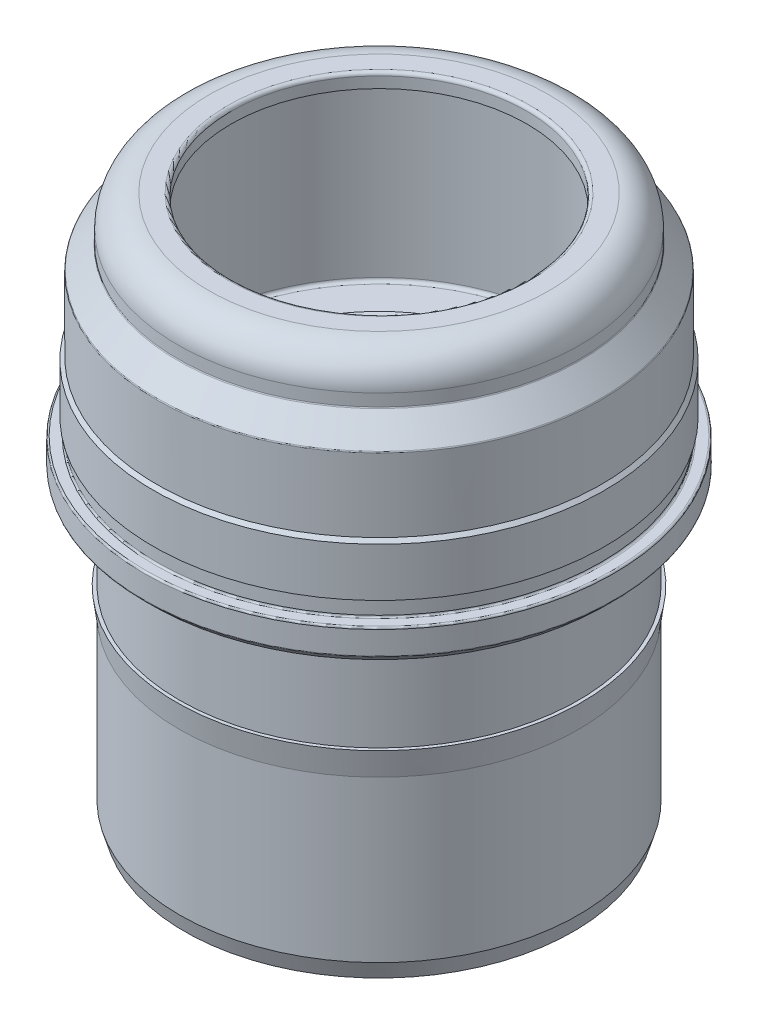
ISO-10303-21;
HEADER;
FILE_DESCRIPTION(('STEP AP214'),'2;1');
FILE_NAME('part.step','',(''),(''),'','','');
FILE_SCHEMA(('AUTOMOTIVE_DESIGN { 1 0 10303 214 1 1 1 1 }'));
ENDSEC;
DATA;
#1=APPLICATION_CONTEXT('core data for automotive mechanical design processes');
#2=APPLICATION_PROTOCOL_DEFINITION('international standard','automotive_design',2000,#1);
#3=PRODUCT_CONTEXT('',#1,'mechanical');
#4=PRODUCT('Part','Part','',(#3));
#5=PRODUCT_RELATED_PRODUCT_CATEGORY('part','',(#4));
#6=PRODUCT_DEFINITION_FORMATION('','',#4);
#7=PRODUCT_DEFINITION_CONTEXT('part definition',#1,'design');
#8=PRODUCT_DEFINITION('design','',#6,#7);
#9=PRODUCT_DEFINITION_SHAPE('','',#8);
#10=(LENGTH_UNIT() NAMED_UNIT(*) SI_UNIT(.MILLI.,.METRE.));
#11=(NAMED_UNIT(*) PLANE_ANGLE_UNIT() SI_UNIT($,.RADIAN.));
#12=(NAMED_UNIT(*) SI_UNIT($,.STERADIAN.) SOLID_ANGLE_UNIT());
#13=UNCERTAINTY_MEASURE_WITH_UNIT(LENGTH_MEASURE(1.E-05),#10,'distance_accuracy_value','');
#14=(GEOMETRIC_REPRESENTATION_CONTEXT(3) GLOBAL_UNCERTAINTY_ASSIGNED_CONTEXT((#13)) GLOBAL_UNIT_ASSIGNED_CONTEXT((#10,
#11,#12)) REPRESENTATION_CONTEXT('',''));
#15=CARTESIAN_POINT('',(0.,0.,0.));
#16=DIRECTION('',(0.,0.,1.));
#17=DIRECTION('',(1.,0.,0.));
#18=AXIS2_PLACEMENT_3D('',#15,#16,#17);
#19=CARTESIAN_POINT('',(0.,0.,0.));
#20=DIRECTION('',(0.,-1.,0.));
#21=DIRECTION('',(0.,0.,-1.));
#22=AXIS2_PLACEMENT_3D('',#19,#20,#21);
#23=CYLINDRICAL_SURFACE('',#22,8.675);
#24=CARTESIAN_POINT('',(0.,19.55,0.));
#25=DIRECTION('',(0.,1.,0.));
#26=DIRECTION('',(0.,0.,1.));
#27=AXIS2_PLACEMENT_3D('',#24,#25,#26);
#28=CIRCLE('',#27,8.675);
#29=CARTESIAN_POINT('',(0.,19.55,8.675));
#30=VERTEX_POINT('',#29);
#31=EDGE_CURVE('E91',#30,#30,#28,.T.);
#32=ORIENTED_EDGE('',*,*,#31,.T.);
#33=EDGE_LOOP('',(#32));
#34=FACE_BOUND('',#33,.T.);
#35=CARTESIAN_POINT('',(0.,0.2,0.));
#36=DIRECTION('',(0.,-1.,0.));
#37=DIRECTION('',(0.,0.,-1.));
#38=AXIS2_PLACEMENT_3D('',#35,#36,#37);
#39=CIRCLE('',#38,8.675);
#40=CARTESIAN_POINT('',(0.,0.2,-8.675));
#41=VERTEX_POINT('',#40);
#42=EDGE_CURVE('E106',#41,#41,#39,.T.);
#43=ORIENTED_EDGE('',*,*,#42,.T.);
#44=EDGE_LOOP('',(#43));
#45=FACE_BOUND('',#44,.T.);
#46=ADVANCED_FACE('F29',(#34,#45),#23,.F.);
#47=CARTESIAN_POINT('',(8.675,19.75,0.));
#48=DIRECTION('',(0.,1.,0.));
#49=DIRECTION('',(0.,0.,1.));
#50=AXIS2_PLACEMENT_3D('',#47,#48,#49);
#51=PLANE('',#50);
#52=CARTESIAN_POINT('',(0.,19.75,0.));
#53=DIRECTION('',(0.,1.,0.));
#54=DIRECTION('',(0.,0.,1.));
#55=AXIS2_PLACEMENT_3D('',#52,#53,#54);
#56=CIRCLE('',#55,10.85);
#57=CARTESIAN_POINT('',(0.,19.75,10.85));
#58=VERTEX_POINT('',#57);
#59=EDGE_CURVE('E85',#58,#58,#56,.T.);
#60=ORIENTED_EDGE('',*,*,#59,.T.);
#61=EDGE_LOOP('',(#60));
#62=FACE_BOUND('',#61,.T.);
#63=CARTESIAN_POINT('',(0.,19.75,0.));
#64=DIRECTION('',(0.,1.,0.));
#65=DIRECTION('',(0.,0.,1.));
#66=AXIS2_PLACEMENT_3D('',#63,#64,#65);
#67=CIRCLE('',#66,8.875);
#68=CARTESIAN_POINT('',(0.,19.75,8.875));
#69=VERTEX_POINT('',#68);
#70=EDGE_CURVE('E94',#69,#69,#67,.F.);
#71=ORIENTED_EDGE('',*,*,#70,.T.);
#72=EDGE_LOOP('',(#71));
#73=FACE_BOUND('',#72,.T.);
#74=ADVANCED_FACE('F167',(#62,#73),#51,.T.);
#75=CARTESIAN_POINT('',(0.,0.,0.));
#76=DIRECTION('',(0.,-1.,0.));
#77=DIRECTION('',(0.,0.,-1.));
#78=AXIS2_PLACEMENT_3D('',#75,#76,#77);
#79=CYLINDRICAL_SURFACE('',#78,11.05);
#80=CARTESIAN_POINT('',(0.,19.95,0.));
#81=DIRECTION('',(0.,1.,0.));
#82=DIRECTION('',(0.,0.,1.));
#83=AXIS2_PLACEMENT_3D('',#80,#81,#82);
#84=CIRCLE('',#83,11.05);
#85=CARTESIAN_POINT('',(0.,19.95,11.05));
#86=VERTEX_POINT('',#85);
#87=EDGE_CURVE('E88',#86,#86,#84,.F.);
#88=ORIENTED_EDGE('',*,*,#87,.T.);
#89=EDGE_LOOP('',(#88));
#90=FACE_BOUND('',#89,.T.);
#91=CARTESIAN_POINT('',(0.,30.25,0.));
#92=DIRECTION('',(0.,-1.,0.));
#93=DIRECTION('',(0.,0.,-1.));
#94=AXIS2_PLACEMENT_3D('',#91,#92,#93);
#95=CIRCLE('',#94,11.05);
#96=CARTESIAN_POINT('',(0.,30.25,-11.05));
#97=VERTEX_POINT('',#96);
#98=EDGE_CURVE('E109',#97,#97,#95,.T.);
#99=ORIENTED_EDGE('',*,*,#98,.F.);
#100=EDGE_LOOP('',(#99));
#101=FACE_BOUND('',#100,.T.);
#102=ADVANCED_FACE('F173',(#90,#101),#79,.F.);
#103=CARTESIAN_POINT('',(0.,30.25,0.));
#104=DIRECTION('',(0.,-1.,0.));
#105=DIRECTION('',(0.,0.,-1.));
#106=AXIS2_PLACEMENT_3D('',#103,#104,#105);
#107=TOROIDAL_SURFACE('',#106,10.05,0.999999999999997);
#108=ORIENTED_EDGE('',*,*,#98,.T.);
#109=EDGE_LOOP('',(#108));
#110=FACE_BOUND('',#109,.T.);
#111=CARTESIAN_POINT('',(0.,31.25,0.));
#112=DIRECTION('',(0.,-1.,0.));
#113=DIRECTION('',(0.,0.,-1.));
#114=AXIS2_PLACEMENT_3D('',#111,#112,#113);
#115=CIRCLE('',#114,10.05);
#116=CARTESIAN_POINT('',(0.,31.25,-10.05));
#117=VERTEX_POINT('',#116);
#118=EDGE_CURVE('E112',#117,#117,#115,.T.);
#119=ORIENTED_EDGE('',*,*,#118,.F.);
#120=EDGE_LOOP('',(#119));
#121=FACE_BOUND('',#120,.T.);
#122=ADVANCED_FACE('F279',(#110,#121),#107,.F.);
#123=CARTESIAN_POINT('',(8.75,31.25,0.));
#124=DIRECTION('',(0.,-1.,0.));
#125=DIRECTION('',(0.,0.,-1.));
#126=AXIS2_PLACEMENT_3D('',#123,#124,#125);
#127=PLANE('',#126);
#128=ORIENTED_EDGE('',*,*,#118,.T.);
#129=EDGE_LOOP('',(#128));
#130=FACE_BOUND('',#129,.T.);
#131=CARTESIAN_POINT('',(0.,31.25,0.));
#132=DIRECTION('',(0.,-1.,0.));
#133=DIRECTION('',(0.,0.,-1.));
#134=AXIS2_PLACEMENT_3D('',#131,#132,#133);
#135=CIRCLE('',#134,8.75);
#136=CARTESIAN_POINT('',(0.,31.25,-8.75));
#137=VERTEX_POINT('',#136);
#138=EDGE_CURVE('E115',#137,#137,#135,.T.);
#139=ORIENTED_EDGE('',*,*,#138,.F.);
#140=EDGE_LOOP('',(#139));
#141=FACE_BOUND('',#140,.T.);
#142=ADVANCED_FACE('F275',(#130,#141),#127,.T.);
#143=CARTESIAN_POINT('',(0.,0.,0.));
#144=DIRECTION('',(0.,-1.,0.));
#145=DIRECTION('',(0.,0.,-1.));
#146=AXIS2_PLACEMENT_3D('',#143,#144,#145);
#147=CYLINDRICAL_SURFACE('',#146,8.75);
#148=CARTESIAN_POINT('',(0.,31.9,0.));
#149=DIRECTION('',(0.,1.,0.));
#150=DIRECTION('',(0.,0.,1.));
#151=AXIS2_PLACEMENT_3D('',#148,#149,#150);
#152=CIRCLE('',#151,8.75);
#153=CARTESIAN_POINT('',(0.,31.9,8.75));
#154=VERTEX_POINT('',#153);
#155=EDGE_CURVE('E97',#154,#154,#152,.T.);
#156=ORIENTED_EDGE('',*,*,#155,.T.);
#157=EDGE_LOOP('',(#156));
#158=FACE_BOUND('',#157,.T.);
#159=ORIENTED_EDGE('',*,*,#138,.T.);
#160=EDGE_LOOP('',(#159));
#161=FACE_BOUND('',#160,.T.);
#162=ADVANCED_FACE('F271',(#158,#161),#147,.F.);
#163=CARTESIAN_POINT('',(10.05,32.1,0.));
#164=DIRECTION('',(0.,1.,0.));
#165=DIRECTION('',(0.,0.,1.));
#166=AXIS2_PLACEMENT_3D('',#163,#164,#165);
#167=PLANE('',#166);
#168=CARTESIAN_POINT('',(0.,32.1,0.));
#169=DIRECTION('',(0.,1.,0.));
#170=DIRECTION('',(0.,0.,1.));
#171=AXIS2_PLACEMENT_3D('',#168,#169,#170);
#172=CIRCLE('',#171,8.95);
#173=CARTESIAN_POINT('',(0.,32.1,8.95));
#174=VERTEX_POINT('',#173);
#175=EDGE_CURVE('E100',#174,#174,#172,.F.);
#176=ORIENTED_EDGE('',*,*,#175,.T.);
#177=EDGE_LOOP('',(#176));
#178=FACE_BOUND('',#177,.T.);
#179=CARTESIAN_POINT('',(0.,32.1,0.));
#180=DIRECTION('',(0.,-1.,0.));
#181=DIRECTION('',(0.,0.,-1.));
#182=AXIS2_PLACEMENT_3D('',#179,#180,#181);
#183=CIRCLE('',#182,10.05);
#184=CARTESIAN_POINT('',(0.,32.1,-10.05));
#185=VERTEX_POINT('',#184);
#186=EDGE_CURVE('E118',#185,#185,#183,.T.);
#187=ORIENTED_EDGE('',*,*,#186,.F.);
#188=EDGE_LOOP('',(#187));
#189=FACE_BOUND('',#188,.T.);
#190=ADVANCED_FACE('F267',(#178,#189),#167,.T.);
#191=CARTESIAN_POINT('',(0.,30.25,0.));
#192=DIRECTION('',(0.,-1.,0.));
#193=DIRECTION('',(0.,0.,-1.));
#194=AXIS2_PLACEMENT_3D('',#191,#192,#193);
#195=TOROIDAL_SURFACE('',#194,10.05,1.85);
#196=ORIENTED_EDGE('',*,*,#186,.T.);
#197=EDGE_LOOP('',(#196));
#198=FACE_BOUND('',#197,.T.);
#199=CARTESIAN_POINT('',(0.,30.25,0.));
#200=DIRECTION('',(0.,-1.,0.));
#201=DIRECTION('',(0.,0.,-1.));
#202=AXIS2_PLACEMENT_3D('',#199,#200,#201);
#203=CIRCLE('',#202,11.9);
#204=CARTESIAN_POINT('',(0.,30.25,-11.9));
#205=VERTEX_POINT('',#204);
#206=EDGE_CURVE('E121',#205,#205,#203,.T.);
#207=ORIENTED_EDGE('',*,*,#206,.F.);
#208=EDGE_LOOP('',(#207));
#209=FACE_BOUND('',#208,.T.);
#210=ADVANCED_FACE('F264',(#198,#209),#195,.T.);
#211=CARTESIAN_POINT('',(0.,0.,0.));
#212=DIRECTION('',(0.,-1.,0.));
#213=DIRECTION('',(0.,0.,-1.));
#214=AXIS2_PLACEMENT_3D('',#211,#212,#213);
#215=CYLINDRICAL_SURFACE('',#214,11.9);
#216=CARTESIAN_POINT('',(0.,29.538146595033,0.));
#217=DIRECTION('',(0.,-1.,0.));
#218=DIRECTION('',(0.,0.,-1.));
#219=AXIS2_PLACEMENT_3D('',#216,#217,#218);
#220=CIRCLE('',#219,11.9);
#221=CARTESIAN_POINT('',(0.,29.538146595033,-11.9));
#222=VERTEX_POINT('',#221);
#223=EDGE_CURVE('E10',#222,#222,#220,.F.);
#224=ORIENTED_EDGE('',*,*,#223,.T.);
#225=EDGE_LOOP('',(#224));
#226=FACE_BOUND('',#225,.T.);
#227=ORIENTED_EDGE('',*,*,#206,.T.);
#228=EDGE_LOOP('',(#227));
#229=FACE_BOUND('',#228,.T.);
#230=ADVANCED_FACE('F261',(#226,#229),#215,.T.);
#231=CARTESIAN_POINT('',(0.,28.1,0.));
#232=DIRECTION('',(0.,-1.,0.));
#233=DIRECTION('',(0.,0.,-1.));
#234=AXIS2_PLACEMENT_3D('',#231,#232,#233);
#235=CONICAL_SURFACE('',#234,13.15,0.72885472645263);
#236=CARTESIAN_POINT('',(0.,28.1284549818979,0.));
#237=DIRECTION('',(0.,1.,0.));
#238=DIRECTION('',(0.,0.,1.));
#239=AXIS2_PLACEMENT_3D('',#236,#237,#238);
#240=CIRCLE('',#239,13.1245937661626);
#241=CARTESIAN_POINT('',(0.,28.1284549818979,13.1245937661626));
#242=VERTEX_POINT('',#241);
#243=EDGE_CURVE('E36',#242,#242,#240,.T.);
#244=ORIENTED_EDGE('',*,*,#243,.T.);
#245=EDGE_LOOP('',(#244));
#246=FACE_BOUND('',#245,.T.);
#247=CARTESIAN_POINT('',(0.,29.4715450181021,0.));
#248=DIRECTION('',(0.,-1.,0.));
#249=DIRECTION('',(0.,0.,-1.));
#250=AXIS2_PLACEMENT_3D('',#247,#248,#249);
#251=CIRCLE('',#250,11.9254062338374);
#252=CARTESIAN_POINT('',(0.,29.4715450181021,-11.9254062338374));
#253=VERTEX_POINT('',#252);
#254=EDGE_CURVE('E40',#253,#253,#251,.T.);
#255=ORIENTED_EDGE('',*,*,#254,.T.);
#256=EDGE_LOOP('',(#255));
#257=FACE_BOUND('',#256,.T.);
#258=ADVANCED_FACE('F231',(#246,#257),#235,.T.);
#259=CARTESIAN_POINT('',(0.,0.,0.));
#260=DIRECTION('',(0.,-1.,0.));
#261=DIRECTION('',(0.,0.,-1.));
#262=AXIS2_PLACEMENT_3D('',#259,#260,#261);
#263=CYLINDRICAL_SURFACE('',#262,13.15);
#264=CARTESIAN_POINT('',(0.,28.061853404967,0.));
#265=DIRECTION('',(0.,1.,0.));
#266=DIRECTION('',(0.,0.,1.));
#267=AXIS2_PLACEMENT_3D('',#264,#265,#266);
#268=CIRCLE('',#267,13.15);
#269=CARTESIAN_POINT('',(0.,28.061853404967,13.15));
#270=VERTEX_POINT('',#269);
#271=EDGE_CURVE('E44',#270,#270,#268,.F.);
#272=ORIENTED_EDGE('',*,*,#271,.T.);
#273=EDGE_LOOP('',(#272));
#274=FACE_BOUND('',#273,.T.);
#275=CARTESIAN_POINT('',(0.,23.73,0.));
#276=DIRECTION('',(0.,-1.,0.));
#277=DIRECTION('',(0.,0.,-1.));
#278=AXIS2_PLACEMENT_3D('',#275,#276,#277);
#279=CIRCLE('',#278,13.15);
#280=CARTESIAN_POINT('',(0.,23.73,-13.15));
#281=VERTEX_POINT('',#280);
#282=EDGE_CURVE('E124',#281,#281,#279,.T.);
#283=ORIENTED_EDGE('',*,*,#282,.F.);
#284=EDGE_LOOP('',(#283));
#285=FACE_BOUND('',#284,.T.);
#286=ADVANCED_FACE('F227',(#274,#285),#263,.T.);
#287=CARTESIAN_POINT('',(0.,23.53,0.));
#288=DIRECTION('',(0.,-1.,0.));
#289=DIRECTION('',(0.,0.,-1.));
#290=AXIS2_PLACEMENT_3D('',#287,#288,#289);
#291=CONICAL_SURFACE('',#290,13.35,0.785398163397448);
#292=ORIENTED_EDGE('',*,*,#282,.T.);
#293=EDGE_LOOP('',(#292));
#294=FACE_BOUND('',#293,.T.);
#295=CARTESIAN_POINT('',(0.,23.53,0.));
#296=DIRECTION('',(0.,-1.,0.));
#297=DIRECTION('',(0.,0.,-1.));
#298=AXIS2_PLACEMENT_3D('',#295,#296,#297);
#299=CIRCLE('',#298,13.35);
#300=CARTESIAN_POINT('',(0.,23.53,-13.35));
#301=VERTEX_POINT('',#300);
#302=EDGE_CURVE('E127',#301,#301,#299,.T.);
#303=ORIENTED_EDGE('',*,*,#302,.F.);
#304=EDGE_LOOP('',(#303));
#305=FACE_BOUND('',#304,.T.);
#306=ADVANCED_FACE('F230',(#294,#305),#291,.T.);
#307=CARTESIAN_POINT('',(0.,0.,0.));
#308=DIRECTION('',(0.,-1.,0.));
#309=DIRECTION('',(0.,0.,-1.));
#310=AXIS2_PLACEMENT_3D('',#307,#308,#309);
#311=CYLINDRICAL_SURFACE('',#310,13.35);
#312=ORIENTED_EDGE('',*,*,#302,.T.);
#313=EDGE_LOOP('',(#312));
#314=FACE_BOUND('',#313,.T.);
#315=CARTESIAN_POINT('',(0.,20.65,0.));
#316=DIRECTION('',(0.,-1.,0.));
#317=DIRECTION('',(0.,0.,-1.));
#318=AXIS2_PLACEMENT_3D('',#315,#316,#317);
#319=CIRCLE('',#318,13.35);
#320=CARTESIAN_POINT('',(0.,20.65,-13.35));
#321=VERTEX_POINT('',#320);
#322=EDGE_CURVE('E130',#321,#321,#319,.T.);
#323=ORIENTED_EDGE('',*,*,#322,.F.);
#324=EDGE_LOOP('',(#323));
#325=FACE_BOUND('',#324,.T.);
#326=ADVANCED_FACE('F237',(#314,#325),#311,.T.);
#327=CARTESIAN_POINT('',(13.35,20.65,0.));
#328=DIRECTION('',(0.,-1.,0.));
#329=DIRECTION('',(0.,0.,-1.));
#330=AXIS2_PLACEMENT_3D('',#327,#328,#329);
#331=PLANE('',#330);
#332=CARTESIAN_POINT('',(0.,20.65,0.));
#333=DIRECTION('',(0.,-1.,0.));
#334=DIRECTION('',(0.,0.,-1.));
#335=AXIS2_PLACEMENT_3D('',#332,#333,#334);
#336=CIRCLE('',#335,13.25);
#337=CARTESIAN_POINT('',(0.,20.65,-13.25));
#338=VERTEX_POINT('',#337);
#339=EDGE_CURVE('E55',#338,#338,#336,.F.);
#340=ORIENTED_EDGE('',*,*,#339,.T.);
#341=EDGE_LOOP('',(#340));
#342=FACE_BOUND('',#341,.T.);
#343=ORIENTED_EDGE('',*,*,#322,.T.);
#344=EDGE_LOOP('',(#343));
#345=FACE_BOUND('',#344,.T.);
#346=ADVANCED_FACE('F243',(#342,#345),#331,.T.);
#347=CARTESIAN_POINT('',(0.,0.,0.));
#348=DIRECTION('',(0.,-1.,0.));
#349=DIRECTION('',(0.,0.,-1.));
#350=AXIS2_PLACEMENT_3D('',#347,#348,#349);
#351=CYLINDRICAL_SURFACE('',#350,13.15);
#352=CARTESIAN_POINT('',(0.,19.75,0.));
#353=DIRECTION('',(0.,1.,0.));
#354=DIRECTION('',(0.,0.,1.));
#355=AXIS2_PLACEMENT_3D('',#352,#353,#354);
#356=CIRCLE('',#355,13.15);
#357=CARTESIAN_POINT('',(0.,19.75,13.15));
#358=VERTEX_POINT('',#357);
#359=EDGE_CURVE('E58',#358,#358,#356,.T.);
#360=ORIENTED_EDGE('',*,*,#359,.T.);
#361=EDGE_LOOP('',(#360));
#362=FACE_BOUND('',#361,.T.);
#363=CARTESIAN_POINT('',(0.,20.55,0.));
#364=DIRECTION('',(0.,-1.,0.));
#365=DIRECTION('',(0.,0.,-1.));
#366=AXIS2_PLACEMENT_3D('',#363,#364,#365);
#367=CIRCLE('',#366,13.15);
#368=CARTESIAN_POINT('',(0.,20.55,-13.15));
#369=VERTEX_POINT('',#368);
#370=EDGE_CURVE('E61',#369,#369,#367,.T.);
#371=ORIENTED_EDGE('',*,*,#370,.T.);
#372=EDGE_LOOP('',(#371));
#373=FACE_BOUND('',#372,.T.);
#374=ADVANCED_FACE('F248',(#362,#373),#351,.T.);
#375=CARTESIAN_POINT('',(13.9,19.65,0.));
#376=DIRECTION('',(0.,1.,0.));
#377=DIRECTION('',(0.,0.,1.));
#378=AXIS2_PLACEMENT_3D('',#375,#376,#377);
#379=PLANE('',#378);
#380=CARTESIAN_POINT('',(0.,19.65,0.));
#381=DIRECTION('',(0.,1.,0.));
#382=DIRECTION('',(0.,0.,1.));
#383=AXIS2_PLACEMENT_3D('',#380,#381,#382);
#384=CIRCLE('',#383,13.25);
#385=CARTESIAN_POINT('',(0.,19.65,13.25));
#386=VERTEX_POINT('',#385);
#387=EDGE_CURVE('E64',#386,#386,#384,.F.);
#388=ORIENTED_EDGE('',*,*,#387,.T.);
#389=EDGE_LOOP('',(#388));
#390=FACE_BOUND('',#389,.T.);
#391=CARTESIAN_POINT('',(0.,19.65,0.));
#392=DIRECTION('',(0.,1.,0.));
#393=DIRECTION('',(0.,0.,1.));
#394=AXIS2_PLACEMENT_3D('',#391,#392,#393);
#395=CIRCLE('',#394,13.8);
#396=CARTESIAN_POINT('',(0.,19.65,13.8));
#397=VERTEX_POINT('',#396);
#398=EDGE_CURVE('E67',#397,#397,#395,.T.);
#399=ORIENTED_EDGE('',*,*,#398,.T.);
#400=EDGE_LOOP('',(#399));
#401=FACE_BOUND('',#400,.T.);
#402=ADVANCED_FACE('F254',(#390,#401),#379,.T.);
#403=CARTESIAN_POINT('',(0.,0.,0.));
#404=DIRECTION('',(0.,-1.,0.));
#405=DIRECTION('',(0.,0.,-1.));
#406=AXIS2_PLACEMENT_3D('',#403,#404,#405);
#407=CYLINDRICAL_SURFACE('',#406,13.9);
#408=CARTESIAN_POINT('',(0.,18.1914213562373,0.));
#409=DIRECTION('',(0.,1.,0.));
#410=DIRECTION('',(0.,0.,1.));
#411=AXIS2_PLACEMENT_3D('',#408,#409,#410);
#412=CIRCLE('',#411,13.9);
#413=CARTESIAN_POINT('',(0.,18.1914213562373,13.9));
#414=VERTEX_POINT('',#413);
#415=EDGE_CURVE('E49',#414,#414,#412,.T.);
#416=ORIENTED_EDGE('',*,*,#415,.T.);
#417=EDGE_LOOP('',(#416));
#418=FACE_BOUND('',#417,.T.);
#419=CARTESIAN_POINT('',(0.,19.55,0.));
#420=DIRECTION('',(0.,1.,0.));
#421=DIRECTION('',(0.,0.,1.));
#422=AXIS2_PLACEMENT_3D('',#419,#420,#421);
#423=CIRCLE('',#422,13.9);
#424=CARTESIAN_POINT('',(0.,19.55,13.9));
#425=VERTEX_POINT('',#424);
#426=EDGE_CURVE('E52',#425,#425,#423,.F.);
#427=ORIENTED_EDGE('',*,*,#426,.T.);
#428=EDGE_LOOP('',(#427));
#429=FACE_BOUND('',#428,.T.);
#430=ADVANCED_FACE('F474',(#418,#429),#407,.T.);
#431=CARTESIAN_POINT('',(0.,17.65,0.));
#432=DIRECTION('',(0.,1.,0.));
#433=DIRECTION('',(0.,0.,1.));
#434=AXIS2_PLACEMENT_3D('',#431,#432,#433);
#435=CONICAL_SURFACE('',#434,13.4,0.785398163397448);
#436=CARTESIAN_POINT('',(0.,17.6792893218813,0.));
#437=DIRECTION('',(0.,-1.,0.));
#438=DIRECTION('',(0.,0.,-1.));
#439=AXIS2_PLACEMENT_3D('',#436,#437,#438);
#440=CIRCLE('',#439,13.4292893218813);
#441=CARTESIAN_POINT('',(0.,17.6792893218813,-13.4292893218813));
#442=VERTEX_POINT('',#441);
#443=EDGE_CURVE('E70',#442,#442,#440,.F.);
#444=ORIENTED_EDGE('',*,*,#443,.T.);
#445=EDGE_LOOP('',(#444));
#446=FACE_BOUND('',#445,.T.);
#447=CARTESIAN_POINT('',(0.,18.1207106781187,0.));
#448=DIRECTION('',(0.,-1.,0.));
#449=DIRECTION('',(0.,0.,-1.));
#450=AXIS2_PLACEMENT_3D('',#447,#448,#449);
#451=CIRCLE('',#450,13.8707106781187);
#452=CARTESIAN_POINT('',(0.,18.1207106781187,-13.8707106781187));
#453=VERTEX_POINT('',#452);
#454=EDGE_CURVE('E73',#453,#453,#451,.T.);
#455=ORIENTED_EDGE('',*,*,#454,.T.);
#456=EDGE_LOOP('',(#455));
#457=FACE_BOUND('',#456,.T.);
#458=ADVANCED_FACE('F464',(#446,#457),#435,.T.);
#459=CARTESIAN_POINT('',(11.8,17.65,0.));
#460=DIRECTION('',(0.,-1.,0.));
#461=DIRECTION('',(0.,0.,-1.));
#462=AXIS2_PLACEMENT_3D('',#459,#460,#461);
#463=PLANE('',#462);
#464=CARTESIAN_POINT('',(0.,17.65,0.));
#465=DIRECTION('',(0.,-1.,0.));
#466=DIRECTION('',(0.,0.,-1.));
#467=AXIS2_PLACEMENT_3D('',#464,#465,#466);
#468=CIRCLE('',#467,11.9);
#469=CARTESIAN_POINT('',(0.,17.65,-11.9));
#470=VERTEX_POINT('',#469);
#471=EDGE_CURVE('E76',#470,#470,#468,.F.);
#472=ORIENTED_EDGE('',*,*,#471,.T.);
#473=EDGE_LOOP('',(#472));
#474=FACE_BOUND('',#473,.T.);
#475=CARTESIAN_POINT('',(0.,17.65,0.));
#476=DIRECTION('',(0.,-1.,0.));
#477=DIRECTION('',(0.,0.,-1.));
#478=AXIS2_PLACEMENT_3D('',#475,#476,#477);
#479=CIRCLE('',#478,13.3585786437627);
#480=CARTESIAN_POINT('',(0.,17.65,-13.3585786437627));
#481=VERTEX_POINT('',#480);
#482=EDGE_CURVE('E79',#481,#481,#479,.T.);
#483=ORIENTED_EDGE('',*,*,#482,.T.);
#484=EDGE_LOOP('',(#483));
#485=FACE_BOUND('',#484,.T.);
#486=ADVANCED_FACE('F454',(#474,#485),#463,.T.);
#487=CARTESIAN_POINT('',(0.,0.,0.));
#488=DIRECTION('',(0.,-1.,0.));
#489=DIRECTION('',(0.,0.,-1.));
#490=AXIS2_PLACEMENT_3D('',#487,#488,#489);
#491=CYLINDRICAL_SURFACE('',#490,11.8);
#492=CARTESIAN_POINT('',(0.,17.55,0.));
#493=DIRECTION('',(0.,-1.,0.));
#494=DIRECTION('',(0.,0.,-1.));
#495=AXIS2_PLACEMENT_3D('',#492,#493,#494);
#496=CIRCLE('',#495,11.8);
#497=CARTESIAN_POINT('',(0.,17.55,-11.8));
#498=VERTEX_POINT('',#497);
#499=EDGE_CURVE('E82',#498,#498,#496,.T.);
#500=ORIENTED_EDGE('',*,*,#499,.T.);
#501=EDGE_LOOP('',(#500));
#502=FACE_BOUND('',#501,.T.);
#503=CARTESIAN_POINT('',(0.,12.,0.));
#504=DIRECTION('',(0.,-1.,0.));
#505=DIRECTION('',(0.,0.,-1.));
#506=AXIS2_PLACEMENT_3D('',#503,#504,#505);
#507=CIRCLE('',#506,11.8);
#508=CARTESIAN_POINT('',(0.,12.,-11.8));
#509=VERTEX_POINT('',#508);
#510=EDGE_CURVE('E133',#509,#509,#507,.T.);
#511=ORIENTED_EDGE('',*,*,#510,.F.);
#512=EDGE_LOOP('',(#511));
#513=FACE_BOUND('',#512,.T.);
#514=ADVANCED_FACE('F351',(#502,#513),#491,.T.);
#515=CARTESIAN_POINT('',(11.8,12.,0.));
#516=DIRECTION('',(0.,1.,0.));
#517=DIRECTION('',(0.,0.,1.));
#518=AXIS2_PLACEMENT_3D('',#515,#516,#517);
#519=PLANE('',#518);
#520=ORIENTED_EDGE('',*,*,#510,.T.);
#521=EDGE_LOOP('',(#520));
#522=FACE_BOUND('',#521,.T.);
#523=CARTESIAN_POINT('',(0.,12.,0.));
#524=DIRECTION('',(0.,-1.,0.));
#525=DIRECTION('',(0.,0.,-1.));
#526=AXIS2_PLACEMENT_3D('',#523,#524,#525);
#527=CIRCLE('',#526,12.);
#528=CARTESIAN_POINT('',(0.,12.,-12.));
#529=VERTEX_POINT('',#528);
#530=EDGE_CURVE('E136',#529,#529,#527,.T.);
#531=ORIENTED_EDGE('',*,*,#530,.F.);
#532=EDGE_LOOP('',(#531));
#533=FACE_BOUND('',#532,.T.);
#534=ADVANCED_FACE('F346',(#522,#533),#519,.T.);
#535=CARTESIAN_POINT('',(0.,10.5,0.));
#536=DIRECTION('',(0.,1.,0.));
#537=DIRECTION('',(0.,0.,1.));
#538=AXIS2_PLACEMENT_3D('',#535,#536,#537);
#539=CONICAL_SURFACE('',#538,11.8,0.132551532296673);
#540=ORIENTED_EDGE('',*,*,#530,.T.);
#541=EDGE_LOOP('',(#540));
#542=FACE_BOUND('',#541,.T.);
#543=CARTESIAN_POINT('',(0.,10.5,0.));
#544=DIRECTION('',(0.,-1.,0.));
#545=DIRECTION('',(0.,0.,-1.));
#546=AXIS2_PLACEMENT_3D('',#543,#544,#545);
#547=CIRCLE('',#546,11.8);
#548=CARTESIAN_POINT('',(0.,10.5,-11.8));
#549=VERTEX_POINT('',#548);
#550=EDGE_CURVE('E139',#549,#549,#547,.T.);
#551=ORIENTED_EDGE('',*,*,#550,.F.);
#552=EDGE_LOOP('',(#551));
#553=FACE_BOUND('',#552,.T.);
#554=ADVANCED_FACE('F163',(#542,#553),#539,.T.);
#555=CARTESIAN_POINT('',(0.,0.,0.));
#556=DIRECTION('',(0.,-1.,0.));
#557=DIRECTION('',(0.,0.,-1.));
#558=AXIS2_PLACEMENT_3D('',#555,#556,#557);
#559=CYLINDRICAL_SURFACE('',#558,11.8);
#560=ORIENTED_EDGE('',*,*,#550,.T.);
#561=EDGE_LOOP('',(#560));
#562=FACE_BOUND('',#561,.T.);
#563=CARTESIAN_POINT('',(0.,1.,0.));
#564=DIRECTION('',(0.,-1.,0.));
#565=DIRECTION('',(0.,0.,-1.));
#566=AXIS2_PLACEMENT_3D('',#563,#564,#565);
#567=CIRCLE('',#566,11.8);
#568=CARTESIAN_POINT('',(0.,1.,-11.8));
#569=VERTEX_POINT('',#568);
#570=EDGE_CURVE('E142',#569,#569,#567,.T.);
#571=ORIENTED_EDGE('',*,*,#570,.F.);
#572=EDGE_LOOP('',(#571));
#573=FACE_BOUND('',#572,.T.);
#574=ADVANCED_FACE('F153',(#562,#573),#559,.T.);
#575=CARTESIAN_POINT('',(0.,0.,0.));
#576=DIRECTION('',(0.,1.,0.));
#577=DIRECTION('',(0.,0.,1.));
#578=AXIS2_PLACEMENT_3D('',#575,#576,#577);
#579=CONICAL_SURFACE('',#578,11.5,0.291456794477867);
#580=ORIENTED_EDGE('',*,*,#570,.T.);
#581=EDGE_LOOP('',(#580));
#582=FACE_BOUND('',#581,.T.);
#583=CARTESIAN_POINT('',(0.,0.,0.));
#584=DIRECTION('',(0.,-1.,0.));
#585=DIRECTION('',(0.,0.,-1.));
#586=AXIS2_PLACEMENT_3D('',#583,#584,#585);
#587=CIRCLE('',#586,11.5);
#588=CARTESIAN_POINT('',(0.,0.,-11.5));
#589=VERTEX_POINT('',#588);
#590=EDGE_CURVE('E145',#589,#589,#587,.T.);
#591=ORIENTED_EDGE('',*,*,#590,.F.);
#592=EDGE_LOOP('',(#591));
#593=FACE_BOUND('',#592,.T.);
#594=ADVANCED_FACE('F151',(#582,#593),#579,.T.);
#595=CARTESIAN_POINT('',(8.675,0.,0.));
#596=DIRECTION('',(0.,-1.,0.));
#597=DIRECTION('',(0.,0.,-1.));
#598=AXIS2_PLACEMENT_3D('',#595,#596,#597);
#599=PLANE('',#598);
#600=CARTESIAN_POINT('',(0.,0.,0.));
#601=DIRECTION('',(0.,-1.,0.));
#602=DIRECTION('',(0.,0.,-1.));
#603=AXIS2_PLACEMENT_3D('',#600,#601,#602);
#604=CIRCLE('',#603,8.875);
#605=CARTESIAN_POINT('',(0.,0.,-8.875));
#606=VERTEX_POINT('',#605);
#607=EDGE_CURVE('E103',#606,#606,#604,.F.);
#608=ORIENTED_EDGE('',*,*,#607,.T.);
#609=EDGE_LOOP('',(#608));
#610=FACE_BOUND('',#609,.T.);
#611=ORIENTED_EDGE('',*,*,#590,.T.);
#612=EDGE_LOOP('',(#611));
#613=FACE_BOUND('',#612,.T.);
#614=ADVANCED_FACE('F149',(#610,#613),#599,.T.);
#615=CARTESIAN_POINT('',(0.,0.2,0.));
#616=DIRECTION('',(0.,-1.,0.));
#617=DIRECTION('',(0.,0.,-1.));
#618=AXIS2_PLACEMENT_3D('',#615,#616,#617);
#619=TOROIDAL_SURFACE('',#618,8.875,0.2);
#620=ORIENTED_EDGE('',*,*,#607,.F.);
#621=EDGE_LOOP('',(#620));
#622=FACE_BOUND('',#621,.T.);
#623=ORIENTED_EDGE('',*,*,#42,.F.);
#624=EDGE_LOOP('',(#623));
#625=FACE_BOUND('',#624,.T.);
#626=ADVANCED_FACE('F160',(#622,#625),#619,.T.);
#627=CARTESIAN_POINT('',(0.,31.9,0.));
#628=DIRECTION('',(0.,1.,0.));
#629=DIRECTION('',(0.,0.,1.));
#630=AXIS2_PLACEMENT_3D('',#627,#628,#629);
#631=TOROIDAL_SURFACE('',#630,8.95,0.2);
#632=ORIENTED_EDGE('',*,*,#155,.F.);
#633=EDGE_LOOP('',(#632));
#634=FACE_BOUND('',#633,.T.);
#635=ORIENTED_EDGE('',*,*,#175,.F.);
#636=EDGE_LOOP('',(#635));
#637=FACE_BOUND('',#636,.T.);
#638=ADVANCED_FACE('F181',(#634,#637),#631,.T.);
#639=CARTESIAN_POINT('',(0.,19.75,0.));
#640=DIRECTION('',(0.,1.,0.));
#641=DIRECTION('',(0.,0.,1.));
#642=AXIS2_PLACEMENT_3D('',#639,#640,#641);
#643=CONICAL_SURFACE('',#642,8.875,0.785398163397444);
#644=ORIENTED_EDGE('',*,*,#31,.F.);
#645=EDGE_LOOP('',(#644));
#646=FACE_BOUND('',#645,.T.);
#647=ORIENTED_EDGE('',*,*,#70,.F.);
#648=EDGE_LOOP('',(#647));
#649=FACE_BOUND('',#648,.T.);
#650=ADVANCED_FACE('F185',(#646,#649),#643,.F.);
#651=CARTESIAN_POINT('',(0.,19.95,0.));
#652=DIRECTION('',(0.,1.,0.));
#653=DIRECTION('',(0.,0.,1.));
#654=AXIS2_PLACEMENT_3D('',#651,#652,#653);
#655=TOROIDAL_SURFACE('',#654,10.85,0.2);
#656=ORIENTED_EDGE('',*,*,#59,.F.);
#657=EDGE_LOOP('',(#656));
#658=FACE_BOUND('',#657,.T.);
#659=ORIENTED_EDGE('',*,*,#87,.F.);
#660=EDGE_LOOP('',(#659));
#661=FACE_BOUND('',#660,.T.);
#662=ADVANCED_FACE('F189',(#658,#661),#655,.F.);
#663=CARTESIAN_POINT('',(0.,17.55,0.));
#664=DIRECTION('',(0.,-1.,0.));
#665=DIRECTION('',(0.,0.,-1.));
#666=AXIS2_PLACEMENT_3D('',#663,#664,#665);
#667=TOROIDAL_SURFACE('',#666,11.9,0.1);
#668=ORIENTED_EDGE('',*,*,#471,.F.);
#669=EDGE_LOOP('',(#668));
#670=FACE_BOUND('',#669,.T.);
#671=ORIENTED_EDGE('',*,*,#499,.F.);
#672=EDGE_LOOP('',(#671));
#673=FACE_BOUND('',#672,.T.);
#674=ADVANCED_FACE('F193',(#670,#673),#667,.F.);
#675=CARTESIAN_POINT('',(0.,17.75,0.));
#676=DIRECTION('',(0.,-1.,0.));
#677=DIRECTION('',(0.,0.,-1.));
#678=AXIS2_PLACEMENT_3D('',#675,#676,#677);
#679=TOROIDAL_SURFACE('',#678,13.3585786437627,0.1);
#680=ORIENTED_EDGE('',*,*,#443,.F.);
#681=EDGE_LOOP('',(#680));
#682=FACE_BOUND('',#681,.T.);
#683=ORIENTED_EDGE('',*,*,#482,.F.);
#684=EDGE_LOOP('',(#683));
#685=FACE_BOUND('',#684,.T.);
#686=ADVANCED_FACE('F197',(#682,#685),#679,.T.);
#687=CARTESIAN_POINT('',(0.,19.75,0.));
#688=DIRECTION('',(0.,1.,0.));
#689=DIRECTION('',(0.,0.,1.));
#690=AXIS2_PLACEMENT_3D('',#687,#688,#689);
#691=TOROIDAL_SURFACE('',#690,13.25,0.1);
#692=ORIENTED_EDGE('',*,*,#359,.F.);
#693=EDGE_LOOP('',(#692));
#694=FACE_BOUND('',#693,.T.);
#695=ORIENTED_EDGE('',*,*,#387,.F.);
#696=EDGE_LOOP('',(#695));
#697=FACE_BOUND('',#696,.T.);
#698=ADVANCED_FACE('F201',(#694,#697),#691,.F.);
#699=CARTESIAN_POINT('',(0.,20.55,0.));
#700=DIRECTION('',(0.,-1.,0.));
#701=DIRECTION('',(0.,0.,-1.));
#702=AXIS2_PLACEMENT_3D('',#699,#700,#701);
#703=TOROIDAL_SURFACE('',#702,13.25,0.1);
#704=ORIENTED_EDGE('',*,*,#339,.F.);
#705=EDGE_LOOP('',(#704));
#706=FACE_BOUND('',#705,.T.);
#707=ORIENTED_EDGE('',*,*,#370,.F.);
#708=EDGE_LOOP('',(#707));
#709=FACE_BOUND('',#708,.T.);
#710=ADVANCED_FACE('F205',(#706,#709),#703,.F.);
#711=CARTESIAN_POINT('',(0.,18.1914213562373,0.));
#712=DIRECTION('',(0.,1.,0.));
#713=DIRECTION('',(0.,0.,1.));
#714=AXIS2_PLACEMENT_3D('',#711,#712,#713);
#715=TOROIDAL_SURFACE('',#714,13.8,0.1);
#716=ORIENTED_EDGE('',*,*,#415,.F.);
#717=EDGE_LOOP('',(#716));
#718=FACE_BOUND('',#717,.T.);
#719=ORIENTED_EDGE('',*,*,#454,.F.);
#720=EDGE_LOOP('',(#719));
#721=FACE_BOUND('',#720,.T.);
#722=ADVANCED_FACE('F209',(#718,#721),#715,.T.);
#723=CARTESIAN_POINT('',(0.,19.55,0.));
#724=DIRECTION('',(0.,1.,0.));
#725=DIRECTION('',(0.,0.,1.));
#726=AXIS2_PLACEMENT_3D('',#723,#724,#725);
#727=TOROIDAL_SURFACE('',#726,13.8,0.1);
#728=ORIENTED_EDGE('',*,*,#398,.F.);
#729=EDGE_LOOP('',(#728));
#730=FACE_BOUND('',#729,.T.);
#731=ORIENTED_EDGE('',*,*,#426,.F.);
#732=EDGE_LOOP('',(#731));
#733=FACE_BOUND('',#732,.T.);
#734=ADVANCED_FACE('F213',(#730,#733),#727,.T.);
#735=CARTESIAN_POINT('',(0.,28.061853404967,0.));
#736=DIRECTION('',(0.,1.,0.));
#737=DIRECTION('',(0.,0.,1.));
#738=AXIS2_PLACEMENT_3D('',#735,#736,#737);
#739=TOROIDAL_SURFACE('',#738,13.05,0.1);
#740=ORIENTED_EDGE('',*,*,#243,.F.);
#741=EDGE_LOOP('',(#740));
#742=FACE_BOUND('',#741,.T.);
#743=ORIENTED_EDGE('',*,*,#271,.F.);
#744=EDGE_LOOP('',(#743));
#745=FACE_BOUND('',#744,.T.);
#746=ADVANCED_FACE('F216',(#742,#745),#739,.T.);
#747=CARTESIAN_POINT('',(0.,29.538146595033,0.));
#748=DIRECTION('',(0.,-1.,0.));
#749=DIRECTION('',(0.,0.,-1.));
#750=AXIS2_PLACEMENT_3D('',#747,#748,#749);
#751=TOROIDAL_SURFACE('',#750,12.,0.1);
#752=ORIENTED_EDGE('',*,*,#223,.F.);
#753=EDGE_LOOP('',(#752));
#754=FACE_BOUND('',#753,.T.);
#755=ORIENTED_EDGE('',*,*,#254,.F.);
#756=EDGE_LOOP('',(#755));
#757=FACE_BOUND('',#756,.T.);
#758=ADVANCED_FACE('F31',(#754,#757),#751,.F.);
#759=CLOSED_SHELL('',(#46,#74,#102,#122,#142,#162,#190,#210,#230,#258,#286,#306,#326,#346,#374,
#402,#430,#458,#486,#514,#534,#554,#574,#594,#614,#626,#638,#650,#662,#674,#686,#698,#710,#722,
#734,#746,#758));
#760=MANIFOLD_SOLID_BREP('B2',#759);
#761=ADVANCED_BREP_SHAPE_REPRESENTATION('',(#18,#760),#14);
#762=SHAPE_DEFINITION_REPRESENTATION(#9,#761);
ENDSEC;
END-ISO-10303-21;
